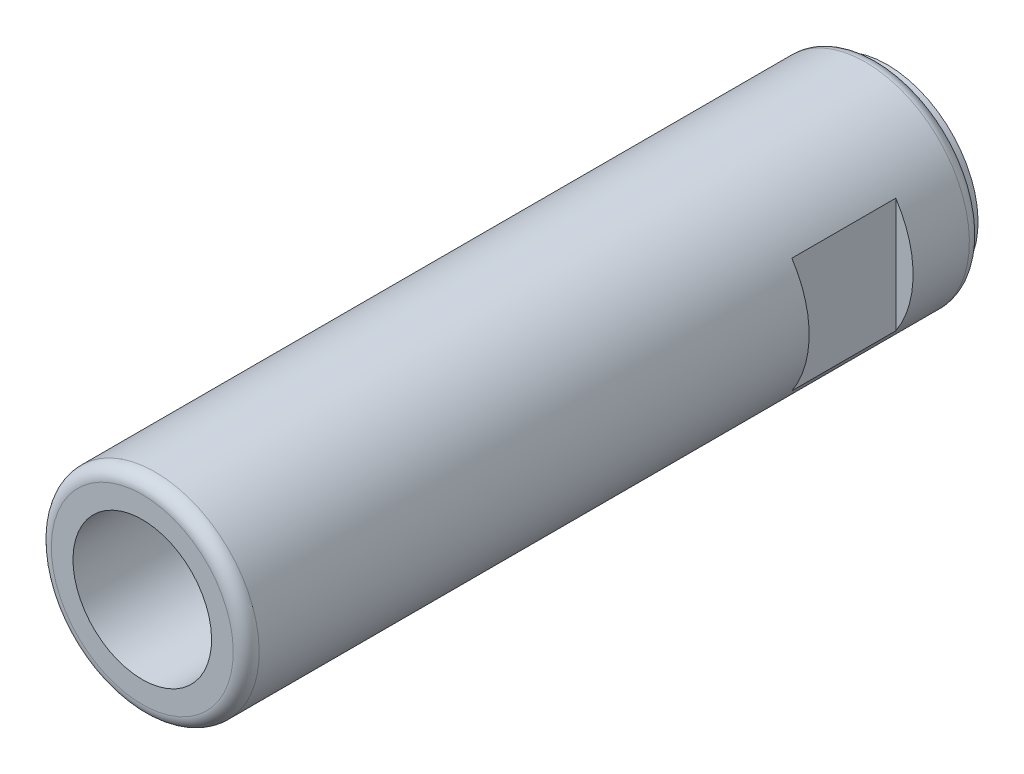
ISO-10303-21;
HEADER;
FILE_DESCRIPTION(('STEP AP214'),'2;1');
FILE_NAME('part.step','',(''),(''),'','','');
FILE_SCHEMA(('AUTOMOTIVE_DESIGN { 1 0 10303 214 1 1 1 1 }'));
ENDSEC;
DATA;
#1=APPLICATION_CONTEXT('core data for automotive mechanical design processes');
#2=APPLICATION_PROTOCOL_DEFINITION('international standard','automotive_design',2000,#1);
#3=PRODUCT_CONTEXT('',#1,'mechanical');
#4=PRODUCT('Part','Part','',(#3));
#5=PRODUCT_RELATED_PRODUCT_CATEGORY('part','',(#4));
#6=PRODUCT_DEFINITION_FORMATION('','',#4);
#7=PRODUCT_DEFINITION_CONTEXT('part definition',#1,'design');
#8=PRODUCT_DEFINITION('design','',#6,#7);
#9=PRODUCT_DEFINITION_SHAPE('','',#8);
#10=(LENGTH_UNIT() NAMED_UNIT(*) SI_UNIT(.MILLI.,.METRE.));
#11=(NAMED_UNIT(*) PLANE_ANGLE_UNIT() SI_UNIT($,.RADIAN.));
#12=(NAMED_UNIT(*) SI_UNIT($,.STERADIAN.) SOLID_ANGLE_UNIT());
#13=UNCERTAINTY_MEASURE_WITH_UNIT(LENGTH_MEASURE(1.E-05),#10,'distance_accuracy_value','');
#14=(GEOMETRIC_REPRESENTATION_CONTEXT(3) GLOBAL_UNCERTAINTY_ASSIGNED_CONTEXT((#13)) GLOBAL_UNIT_ASSIGNED_CONTEXT((#10,
#11,#12)) REPRESENTATION_CONTEXT('',''));
#15=CARTESIAN_POINT('',(0.,0.,0.));
#16=DIRECTION('',(0.,0.,1.));
#17=DIRECTION('',(1.,0.,0.));
#18=AXIS2_PLACEMENT_3D('',#15,#16,#17);
#19=CARTESIAN_POINT('',(0.,0.,0.));
#20=DIRECTION('',(0.,0.,1.));
#21=DIRECTION('',(0.,-1.,0.));
#22=AXIS2_PLACEMENT_3D('',#19,#20,#21);
#23=CYLINDRICAL_SURFACE('',#22,10.5);
#24=CARTESIAN_POINT('',(0.,0.,0.));
#25=DIRECTION('',(0.,0.,-1.));
#26=DIRECTION('',(0.,1.,0.));
#27=AXIS2_PLACEMENT_3D('',#24,#25,#26);
#28=CIRCLE('',#27,10.5);
#29=CARTESIAN_POINT('',(0.,10.5,0.));
#30=VERTEX_POINT('',#29);
#31=EDGE_CURVE('E92',#30,#30,#28,.T.);
#32=ORIENTED_EDGE('',*,*,#31,.F.);
#33=EDGE_LOOP('',(#32));
#34=FACE_BOUND('',#33,.T.);
#35=CARTESIAN_POINT('',(0.,0.,1.));
#36=DIRECTION('',(0.,0.,-1.));
#37=DIRECTION('',(0.,1.,0.));
#38=AXIS2_PLACEMENT_3D('',#35,#36,#37);
#39=CIRCLE('',#38,10.5);
#40=CARTESIAN_POINT('',(0.,10.5,1.));
#41=VERTEX_POINT('',#40);
#42=EDGE_CURVE('E78',#41,#41,#39,.T.);
#43=ORIENTED_EDGE('',*,*,#42,.T.);
#44=EDGE_LOOP('',(#43));
#45=FACE_BOUND('',#44,.T.);
#46=ADVANCED_FACE('F14',(#34,#45),#23,.T.);
#47=CARTESIAN_POINT('',(0.,0.,0.));
#48=DIRECTION('',(0.,0.,-1.));
#49=DIRECTION('',(0.,1.,0.));
#50=AXIS2_PLACEMENT_3D('',#47,#48,#49);
#51=PLANE('',#50);
#52=CARTESIAN_POINT('',(0.,0.,0.));
#53=DIRECTION('',(0.,0.,1.));
#54=DIRECTION('',(0.,-1.,0.));
#55=AXIS2_PLACEMENT_3D('',#52,#53,#54);
#56=CIRCLE('',#55,8.);
#57=CARTESIAN_POINT('',(0.,-8.,0.));
#58=VERTEX_POINT('',#57);
#59=EDGE_CURVE('E101',#58,#58,#56,.T.);
#60=ORIENTED_EDGE('',*,*,#59,.T.);
#61=EDGE_LOOP('',(#60));
#62=FACE_BOUND('',#61,.T.);
#63=ORIENTED_EDGE('',*,*,#31,.T.);
#64=EDGE_LOOP('',(#63));
#65=FACE_BOUND('',#64,.T.);
#66=ADVANCED_FACE('F105',(#62,#65),#51,.T.);
#67=CARTESIAN_POINT('',(10.5,0.,86.));
#68=DIRECTION('',(0.,0.,1.));
#69=DIRECTION('',(0.,-1.,0.));
#70=AXIS2_PLACEMENT_3D('',#67,#68,#69);
#71=PLANE('',#70);
#72=CARTESIAN_POINT('',(0.,0.,86.));
#73=DIRECTION('',(0.,0.,1.));
#74=DIRECTION('',(0.,-1.,0.));
#75=AXIS2_PLACEMENT_3D('',#72,#73,#74);
#76=CIRCLE('',#75,8.);
#77=CARTESIAN_POINT('',(0.,-8.,86.));
#78=VERTEX_POINT('',#77);
#79=EDGE_CURVE('E98',#78,#78,#76,.T.);
#80=ORIENTED_EDGE('',*,*,#79,.F.);
#81=EDGE_LOOP('',(#80));
#82=FACE_BOUND('',#81,.T.);
#83=CARTESIAN_POINT('',(0.,0.,86.));
#84=DIRECTION('',(0.,0.,-1.));
#85=DIRECTION('',(0.,1.,0.));
#86=AXIS2_PLACEMENT_3D('',#83,#84,#85);
#87=CIRCLE('',#86,10.5);
#88=CARTESIAN_POINT('',(0.,10.5,86.));
#89=VERTEX_POINT('',#88);
#90=EDGE_CURVE('E87',#89,#89,#87,.T.);
#91=ORIENTED_EDGE('',*,*,#90,.F.);
#92=EDGE_LOOP('',(#91));
#93=FACE_BOUND('',#92,.T.);
#94=ADVANCED_FACE('F16',(#82,#93),#71,.T.);
#95=CARTESIAN_POINT('',(0.,0.,9.));
#96=DIRECTION('',(0.,0.,1.));
#97=DIRECTION('',(0.,-1.,0.));
#98=AXIS2_PLACEMENT_3D('',#95,#96,#97);
#99=PLANE('',#98);
#100=DIRECTION('',(0.,-1.,0.));
#101=VECTOR('',#100,1.);
#102=CARTESIAN_POINT('',(-10.,24.,9.));
#103=LINE('',#102,#101);
#104=CARTESIAN_POINT('',(-10.,6.6332495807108,9.));
#105=VERTEX_POINT('',#104);
#106=CARTESIAN_POINT('',(-10.,-6.6332495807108,9.));
#107=VERTEX_POINT('',#106);
#108=EDGE_CURVE('E30',#105,#107,#103,.T.);
#109=ORIENTED_EDGE('',*,*,#108,.F.);
#110=CARTESIAN_POINT('',(0.,0.,9.));
#111=DIRECTION('',(0.,0.,1.));
#112=DIRECTION('',(0.,-1.,0.));
#113=AXIS2_PLACEMENT_3D('',#110,#111,#112);
#114=CIRCLE('',#113,12.);
#115=EDGE_CURVE('E54',#107,#105,#114,.F.);
#116=ORIENTED_EDGE('',*,*,#115,.F.);
#117=EDGE_LOOP('',(#109,#116));
#118=FACE_BOUND('',#117,.T.);
#119=ADVANCED_FACE('F55',(#118),#99,.T.);
#120=CARTESIAN_POINT('',(-10.,24.,21.));
#121=DIRECTION('',(1.,0.,0.));
#122=DIRECTION('',(0.,1.,0.));
#123=AXIS2_PLACEMENT_3D('',#120,#121,#122);
#124=PLANE('',#123);
#125=DIRECTION('',(0.,0.,-1.));
#126=VECTOR('',#125,1.);
#127=CARTESIAN_POINT('',(-10.,-6.6332495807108,1.));
#128=LINE('',#127,#126);
#129=CARTESIAN_POINT('',(-10.,-6.6332495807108,21.));
#130=VERTEX_POINT('',#129);
#131=EDGE_CURVE('E18',#107,#130,#128,.F.);
#132=ORIENTED_EDGE('',*,*,#131,.T.);
#133=DIRECTION('',(0.,-1.,0.));
#134=VECTOR('',#133,1.);
#135=CARTESIAN_POINT('',(-10.,24.,21.));
#136=LINE('',#135,#134);
#137=CARTESIAN_POINT('',(-10.,6.6332495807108,21.));
#138=VERTEX_POINT('',#137);
#139=EDGE_CURVE('E89',#138,#130,#136,.T.);
#140=ORIENTED_EDGE('',*,*,#139,.F.);
#141=DIRECTION('',(0.,0.,-1.));
#142=VECTOR('',#141,1.);
#143=CARTESIAN_POINT('',(-10.,6.6332495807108,1.));
#144=LINE('',#143,#142);
#145=EDGE_CURVE('E59',#138,#105,#144,.T.);
#146=ORIENTED_EDGE('',*,*,#145,.T.);
#147=ORIENTED_EDGE('',*,*,#108,.T.);
#148=EDGE_LOOP('',(#132,#140,#146,#147));
#149=FACE_BOUND('',#148,.T.);
#150=ADVANCED_FACE('F63',(#149),#124,.F.);
#151=CARTESIAN_POINT('',(0.,0.,21.));
#152=DIRECTION('',(0.,0.,1.));
#153=DIRECTION('',(0.,-1.,0.));
#154=AXIS2_PLACEMENT_3D('',#151,#152,#153);
#155=PLANE('',#154);
#156=CARTESIAN_POINT('',(0.,0.,21.));
#157=DIRECTION('',(0.,0.,1.));
#158=DIRECTION('',(0.,-1.,0.));
#159=AXIS2_PLACEMENT_3D('',#156,#157,#158);
#160=CIRCLE('',#159,12.);
#161=EDGE_CURVE('E9',#130,#138,#160,.F.);
#162=ORIENTED_EDGE('',*,*,#161,.T.);
#163=ORIENTED_EDGE('',*,*,#139,.T.);
#164=EDGE_LOOP('',(#162,#163));
#165=FACE_BOUND('',#164,.T.);
#166=ADVANCED_FACE('F134',(#165),#155,.F.);
#167=DIRECTION('',(0.,1.,0.));
#168=VECTOR('',#167,1.);
#169=CARTESIAN_POINT('',(10.,-24.,21.));
#170=LINE('',#169,#168);
#171=CARTESIAN_POINT('',(10.,-6.6332495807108,21.));
#172=VERTEX_POINT('',#171);
#173=CARTESIAN_POINT('',(10.,6.6332495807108,21.));
#174=VERTEX_POINT('',#173);
#175=EDGE_CURVE('E66',#172,#174,#170,.T.);
#176=ORIENTED_EDGE('',*,*,#175,.T.);
#177=EDGE_CURVE('E24',#174,#172,#160,.F.);
#178=ORIENTED_EDGE('',*,*,#177,.T.);
#179=EDGE_LOOP('',(#176,#178));
#180=FACE_BOUND('',#179,.T.);
#181=ADVANCED_FACE('F130',(#180),#155,.F.);
#182=DIRECTION('',(0.,1.,0.));
#183=VECTOR('',#182,1.);
#184=CARTESIAN_POINT('',(10.,-24.,9.));
#185=LINE('',#184,#183);
#186=CARTESIAN_POINT('',(10.,-6.6332495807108,9.));
#187=VERTEX_POINT('',#186);
#188=CARTESIAN_POINT('',(10.,6.6332495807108,9.));
#189=VERTEX_POINT('',#188);
#190=EDGE_CURVE('E37',#187,#189,#185,.T.);
#191=ORIENTED_EDGE('',*,*,#190,.F.);
#192=EDGE_CURVE('E61',#189,#187,#114,.F.);
#193=ORIENTED_EDGE('',*,*,#192,.F.);
#194=EDGE_LOOP('',(#191,#193));
#195=FACE_BOUND('',#194,.T.);
#196=ADVANCED_FACE('F133',(#195),#99,.T.);
#197=CARTESIAN_POINT('',(10.,-24.,21.));
#198=DIRECTION('',(-1.,0.,0.));
#199=DIRECTION('',(0.,-1.,0.));
#200=AXIS2_PLACEMENT_3D('',#197,#198,#199);
#201=PLANE('',#200);
#202=DIRECTION('',(0.,0.,-1.));
#203=VECTOR('',#202,1.);
#204=CARTESIAN_POINT('',(10.,6.6332495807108,1.));
#205=LINE('',#204,#203);
#206=EDGE_CURVE('E72',#189,#174,#205,.F.);
#207=ORIENTED_EDGE('',*,*,#206,.T.);
#208=ORIENTED_EDGE('',*,*,#175,.F.);
#209=DIRECTION('',(0.,0.,-1.));
#210=VECTOR('',#209,1.);
#211=CARTESIAN_POINT('',(10.,-6.6332495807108,1.));
#212=LINE('',#211,#210);
#213=EDGE_CURVE('E75',#172,#187,#212,.T.);
#214=ORIENTED_EDGE('',*,*,#213,.T.);
#215=ORIENTED_EDGE('',*,*,#190,.T.);
#216=EDGE_LOOP('',(#207,#208,#214,#215));
#217=FACE_BOUND('',#216,.T.);
#218=ADVANCED_FACE('F138',(#217),#201,.F.);
#219=CARTESIAN_POINT('',(0.,0.,84.5));
#220=DIRECTION('',(0.,0.,-1.));
#221=DIRECTION('',(0.,1.,0.));
#222=AXIS2_PLACEMENT_3D('',#219,#220,#221);
#223=TOROIDAL_SURFACE('',#222,10.5,1.49999999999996);
#224=ORIENTED_EDGE('',*,*,#90,.T.);
#225=EDGE_LOOP('',(#224));
#226=FACE_BOUND('',#225,.T.);
#227=CARTESIAN_POINT('',(0.,0.,84.5));
#228=DIRECTION('',(0.,0.,-1.));
#229=DIRECTION('',(0.,1.,0.));
#230=AXIS2_PLACEMENT_3D('',#227,#228,#229);
#231=CIRCLE('',#230,12.);
#232=CARTESIAN_POINT('',(0.,12.,84.5));
#233=VERTEX_POINT('',#232);
#234=EDGE_CURVE('E84',#233,#233,#231,.T.);
#235=ORIENTED_EDGE('',*,*,#234,.F.);
#236=EDGE_LOOP('',(#235));
#237=FACE_BOUND('',#236,.T.);
#238=ADVANCED_FACE('F143',(#226,#237),#223,.T.);
#239=CARTESIAN_POINT('',(0.,0.,1.));
#240=DIRECTION('',(0.,0.,-1.));
#241=DIRECTION('',(0.,1.,0.));
#242=AXIS2_PLACEMENT_3D('',#239,#240,#241);
#243=CYLINDRICAL_SURFACE('',#242,12.);
#244=ORIENTED_EDGE('',*,*,#234,.T.);
#245=EDGE_LOOP('',(#244));
#246=FACE_BOUND('',#245,.T.);
#247=ORIENTED_EDGE('',*,*,#206,.F.);
#248=ORIENTED_EDGE('',*,*,#192,.T.);
#249=ORIENTED_EDGE('',*,*,#213,.F.);
#250=ORIENTED_EDGE('',*,*,#177,.F.);
#251=EDGE_LOOP('',(#247,#248,#249,#250));
#252=FACE_BOUND('',#251,.T.);
#253=ORIENTED_EDGE('',*,*,#161,.F.);
#254=ORIENTED_EDGE('',*,*,#131,.F.);
#255=ORIENTED_EDGE('',*,*,#115,.T.);
#256=ORIENTED_EDGE('',*,*,#145,.F.);
#257=EDGE_LOOP('',(#253,#254,#255,#256));
#258=FACE_BOUND('',#257,.T.);
#259=CARTESIAN_POINT('',(0.,0.,2.5));
#260=DIRECTION('',(0.,0.,-1.));
#261=DIRECTION('',(0.,1.,0.));
#262=AXIS2_PLACEMENT_3D('',#259,#260,#261);
#263=CIRCLE('',#262,12.);
#264=CARTESIAN_POINT('',(0.,12.,2.5));
#265=VERTEX_POINT('',#264);
#266=EDGE_CURVE('E81',#265,#265,#263,.T.);
#267=ORIENTED_EDGE('',*,*,#266,.F.);
#268=EDGE_LOOP('',(#267));
#269=FACE_BOUND('',#268,.T.);
#270=ADVANCED_FACE('F69',(#246,#252,#258,#269),#243,.T.);
#271=CARTESIAN_POINT('',(0.,0.,2.5));
#272=DIRECTION('',(0.,0.,-1.));
#273=DIRECTION('',(0.,1.,0.));
#274=AXIS2_PLACEMENT_3D('',#271,#272,#273);
#275=TOROIDAL_SURFACE('',#274,10.5,1.5);
#276=ORIENTED_EDGE('',*,*,#266,.T.);
#277=EDGE_LOOP('',(#276));
#278=FACE_BOUND('',#277,.T.);
#279=ORIENTED_EDGE('',*,*,#42,.F.);
#280=EDGE_LOOP('',(#279));
#281=FACE_BOUND('',#280,.T.);
#282=ADVANCED_FACE('F110',(#278,#281),#275,.T.);
#283=CARTESIAN_POINT('',(0.,0.,0.));
#284=DIRECTION('',(0.,0.,1.));
#285=DIRECTION('',(0.,-1.,0.));
#286=AXIS2_PLACEMENT_3D('',#283,#284,#285);
#287=CYLINDRICAL_SURFACE('',#286,8.);
#288=ORIENTED_EDGE('',*,*,#79,.T.);
#289=EDGE_LOOP('',(#288));
#290=FACE_BOUND('',#289,.T.);
#291=ORIENTED_EDGE('',*,*,#59,.F.);
#292=EDGE_LOOP('',(#291));
#293=FACE_BOUND('',#292,.T.);
#294=ADVANCED_FACE('F108',(#290,#293),#287,.F.);
#295=CLOSED_SHELL('',(#46,#66,#94,#119,#150,#166,#181,#196,#218,#238,#270,#282,#294));
#296=MANIFOLD_SOLID_BREP('B1',#295);
#297=ADVANCED_BREP_SHAPE_REPRESENTATION('',(#18,#296),#14);
#298=SHAPE_DEFINITION_REPRESENTATION(#9,#297);
ENDSEC;
END-ISO-10303-21;
